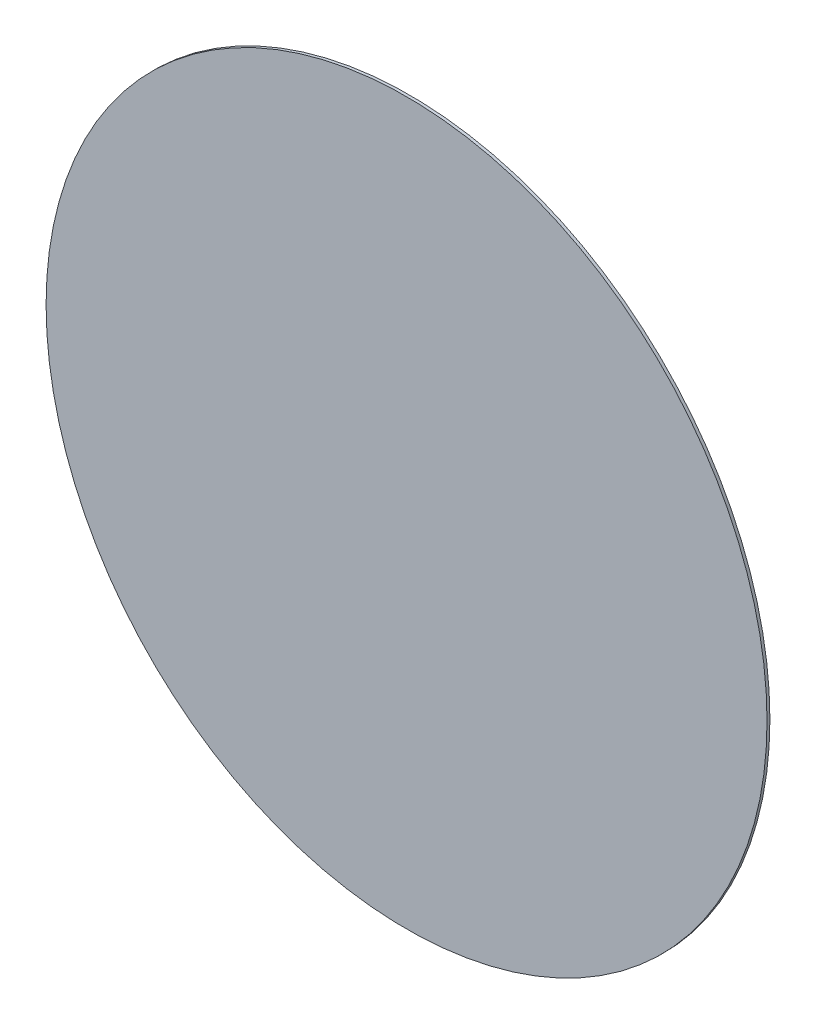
ISO-10303-21;
HEADER;
FILE_DESCRIPTION(('STEP AP214'),'2;1');
FILE_NAME('part.step','',(''),(''),'','','');
FILE_SCHEMA(('AUTOMOTIVE_DESIGN { 1 0 10303 214 1 1 1 1 }'));
ENDSEC;
DATA;
#1=APPLICATION_CONTEXT('core data for automotive mechanical design processes');
#2=APPLICATION_PROTOCOL_DEFINITION('international standard','automotive_design',2000,#1);
#3=PRODUCT_CONTEXT('',#1,'mechanical');
#4=PRODUCT('Part','Part','',(#3));
#5=PRODUCT_RELATED_PRODUCT_CATEGORY('part','',(#4));
#6=PRODUCT_DEFINITION_FORMATION('','',#4);
#7=PRODUCT_DEFINITION_CONTEXT('part definition',#1,'design');
#8=PRODUCT_DEFINITION('design','',#6,#7);
#9=PRODUCT_DEFINITION_SHAPE('','',#8);
#10=(LENGTH_UNIT() NAMED_UNIT(*) SI_UNIT(.MILLI.,.METRE.));
#11=(NAMED_UNIT(*) PLANE_ANGLE_UNIT() SI_UNIT($,.RADIAN.));
#12=(NAMED_UNIT(*) SI_UNIT($,.STERADIAN.) SOLID_ANGLE_UNIT());
#13=UNCERTAINTY_MEASURE_WITH_UNIT(LENGTH_MEASURE(1.E-05),#10,'distance_accuracy_value','');
#14=(GEOMETRIC_REPRESENTATION_CONTEXT(3) GLOBAL_UNCERTAINTY_ASSIGNED_CONTEXT((#13)) GLOBAL_UNIT_ASSIGNED_CONTEXT((#10,
#11,#12)) REPRESENTATION_CONTEXT('',''));
#15=CARTESIAN_POINT('',(0.,0.,0.));
#16=DIRECTION('',(0.,0.,1.));
#17=DIRECTION('',(1.,0.,0.));
#18=AXIS2_PLACEMENT_3D('',#15,#16,#17);
#19=CARTESIAN_POINT('',(0.,0.,0.001));
#20=DIRECTION('',(0.,0.,1.));
#21=DIRECTION('',(1.,0.,0.));
#22=AXIS2_PLACEMENT_3D('',#19,#20,#21);
#23=PLANE('',#22);
#24=CARTESIAN_POINT('',(0.,0.,0.001));
#25=DIRECTION('',(0.,0.,1.));
#26=DIRECTION('',(-1.,0.,0.));
#27=AXIS2_PLACEMENT_3D('',#24,#25,#26);
#28=CIRCLE('',#27,0.125);
#29=CARTESIAN_POINT('',(0.125,0.,0.001));
#30=VERTEX_POINT('',#29);
#31=EDGE_CURVE('E42',#30,#30,#28,.T.);
#32=ORIENTED_EDGE('',*,*,#31,.T.);
#33=EDGE_LOOP('',(#32));
#34=FACE_BOUND('',#33,.T.);
#35=ADVANCED_FACE('F17',(#34),#23,.T.);
#36=CARTESIAN_POINT('',(0.,0.,0.));
#37=DIRECTION('',(0.,0.,1.));
#38=DIRECTION('',(1.,0.,0.));
#39=AXIS2_PLACEMENT_3D('',#36,#37,#38);
#40=PLANE('',#39);
#41=CARTESIAN_POINT('',(0.,0.,0.));
#42=DIRECTION('',(0.,0.,-1.));
#43=DIRECTION('',(-1.,0.,0.));
#44=AXIS2_PLACEMENT_3D('',#41,#42,#43);
#45=CIRCLE('',#44,0.125);
#46=CARTESIAN_POINT('',(0.125,0.,0.));
#47=VERTEX_POINT('',#46);
#48=EDGE_CURVE('E11',#47,#47,#45,.T.);
#49=ORIENTED_EDGE('',*,*,#48,.T.);
#50=EDGE_LOOP('',(#49));
#51=FACE_BOUND('',#50,.T.);
#52=ADVANCED_FACE('F64',(#51),#40,.F.);
#53=CARTESIAN_POINT('',(0.,0.,0.));
#54=DIRECTION('',(0.,0.,1.));
#55=DIRECTION('',(-1.,0.,0.));
#56=AXIS2_PLACEMENT_3D('',#53,#54,#55);
#57=CYLINDRICAL_SURFACE('',#56,0.125);
#58=ORIENTED_EDGE('',*,*,#31,.F.);
#59=DIRECTION('',(0.,0.,-1.));
#60=VECTOR('',#59,1.);
#61=CARTESIAN_POINT('',(0.125,0.,0.));
#62=LINE('',#61,#60);
#63=EDGE_CURVE('E26',#30,#47,#62,.T.);
#64=ORIENTED_EDGE('',*,*,#63,.T.);
#65=ORIENTED_EDGE('',*,*,#48,.F.);
#66=ORIENTED_EDGE('',*,*,#63,.F.);
#67=EDGE_LOOP('',(#58,#64,#65,#66));
#68=FACE_BOUND('',#67,.T.);
#69=ADVANCED_FACE('F41',(#68),#57,.T.);
#70=CLOSED_SHELL('',(#35,#52,#69));
#71=MANIFOLD_SOLID_BREP('B1',#70);
#72=ADVANCED_BREP_SHAPE_REPRESENTATION('',(#18,#71),#14);
#73=SHAPE_DEFINITION_REPRESENTATION(#9,#72);
ENDSEC;
END-ISO-10303-21;
